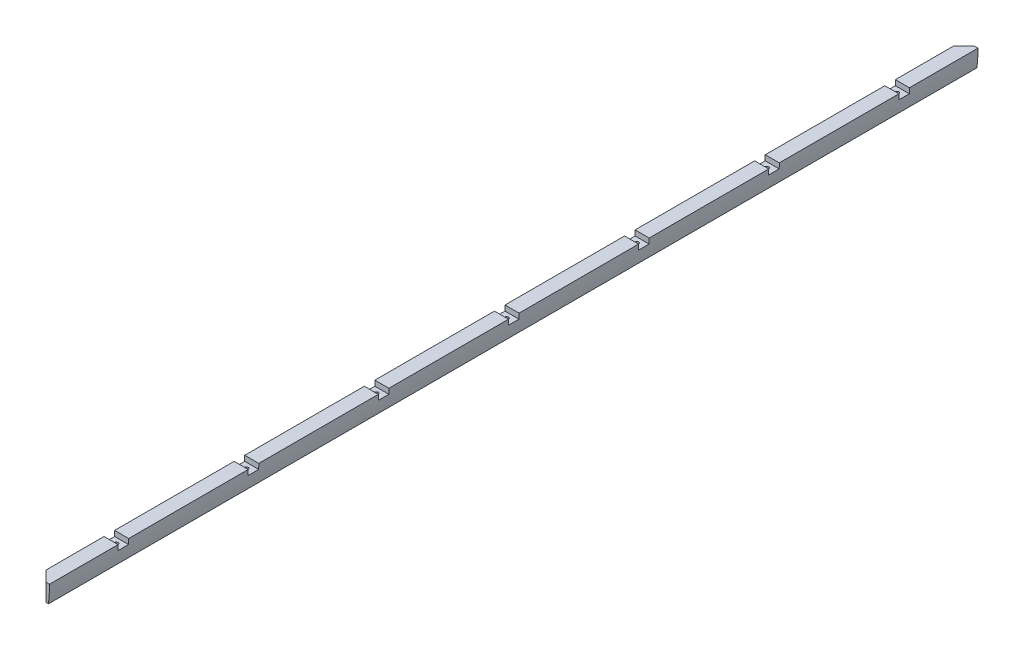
from build123d import *

# Parameters (mm, degrees)
BASE_EXTRUDE_DEPTH      = 1676.4
SKETCH2_W               = 196.875309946
SKETCH2_H               = 19.05
SLOTCUTS_DEPTH          = 9.525
LPATTERN1_COUNT         = 7
LPATTERN1_PITCH         = 234.95
RINGCLEARANCE_DEPTH     = 1697.793194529
F_1_4_CLEARANCE_HOLE1_D = 6.7564
LPATTERN2_COUNT         = 7
LPATTERN2_PITCH         = 234.95


with BuildPart() as part:
    # Sketch1 → Base-Extrude (new body)
    with BuildSketch(Plane.XY):
        with BuildLine():
            Line((234.95, 0), (260.35, 0))
            ThreePointArc((260.35, 0), (259.863738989, -15.904705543), (258.406772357, -31.75))
            Line((258.406772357, -31.75), (234.95, -31.75))
            Line((234.95, -31.75), (234.95, 0))
        make_face()
    extrude(amount=BASE_EXTRUDE_DEPTH)

    # Sketch2 → SlotCuts (cut)
    with BuildSketch(Plane(origin=(0, 0, 0), x_dir=(-1, 0, 0), z_dir=(0, 1, 0))):
        with Locations((-253.960106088, 133.35)):
            Rectangle(SKETCH2_W, SKETCH2_H)
    slotcuts = extrude(amount=-SLOTCUTS_DEPTH, mode=Mode.SUBTRACT)

    # LPattern1: SlotCuts ×7
    with Locations(*[(0, 0, i * LPATTERN1_PITCH) for i in range(1, LPATTERN1_COUNT)]):
        add(slotcuts, mode=Mode.SUBTRACT)

    # Sketch3 → RingClearance (cut, through all)
    with BuildSketch(Plane(origin=(0, 0, 0), x_dir=(-1, 0, 0), z_dir=(0, 1, 0))):
        Polygon((-254, 1676.4), (-234.95, 1657.35), (-234.95, 1676.4), align=None)
        Polygon((-254, 0), (-234.95, 19.05), (-234.95, 0), align=None)
    extrude(amount=-RINGCLEARANCE_DEPTH, mode=Mode.SUBTRACT)

    # 1_4 Clearance Hole1 (through all)
    with Locations(Plane(origin=(0, -9.525, 0), x_dir=(-1, 0, 0), z_dir=(0, 1, 0))):
        with Locations((-247.562851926, 133.35)):
            f_1_4_clearance_hole1 = Hole(F_1_4_CLEARANCE_HOLE1_D / 2)

    # LPattern2: 1_4 Clearance Hole1 ×7
    with Locations(*[(0, 0, i * LPATTERN2_PITCH) for i in range(1, LPATTERN2_COUNT)]):
        add(f_1_4_clearance_hole1, mode=Mode.SUBTRACT)


solid = part.part
